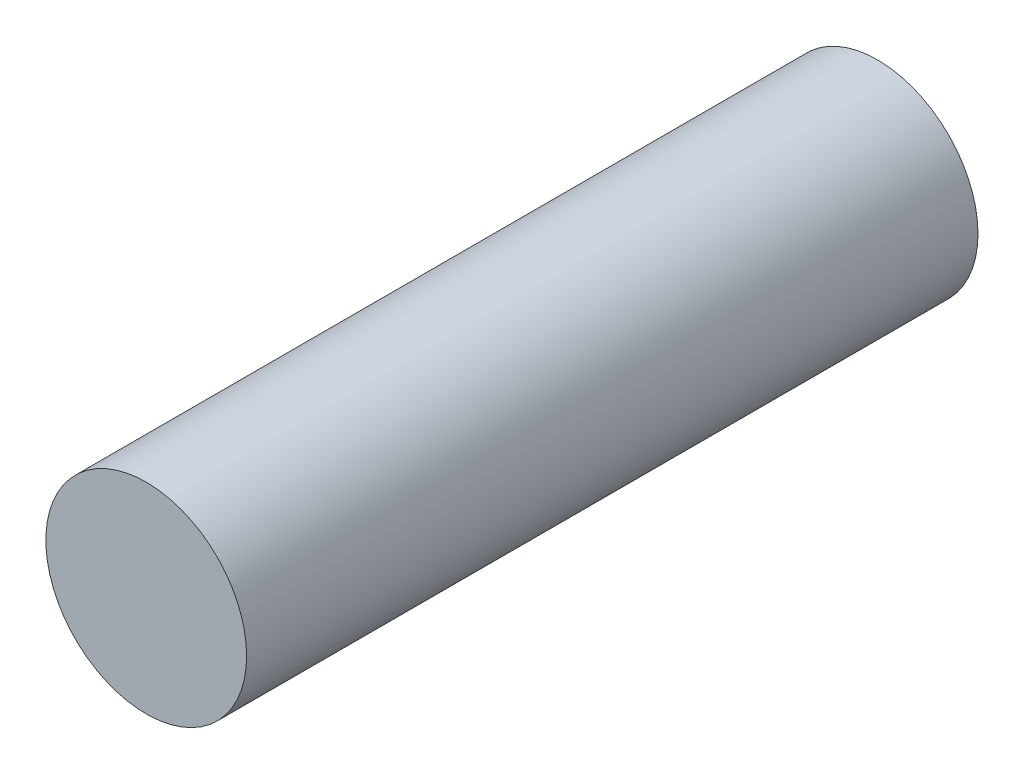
from build123d import *

# Parameters (mm, degrees)
SKETCH1_R           = 14
BOSS_EXTRUDE1_DEPTH = 51


with BuildPart() as part:
    # Sketch1 → Boss-Extrude1 (new, symmetric)
    with BuildSketch(Plane.XY):
        Circle(SKETCH1_R)
    extrude(amount=BOSS_EXTRUDE1_DEPTH, both=True)


solid = part.part
